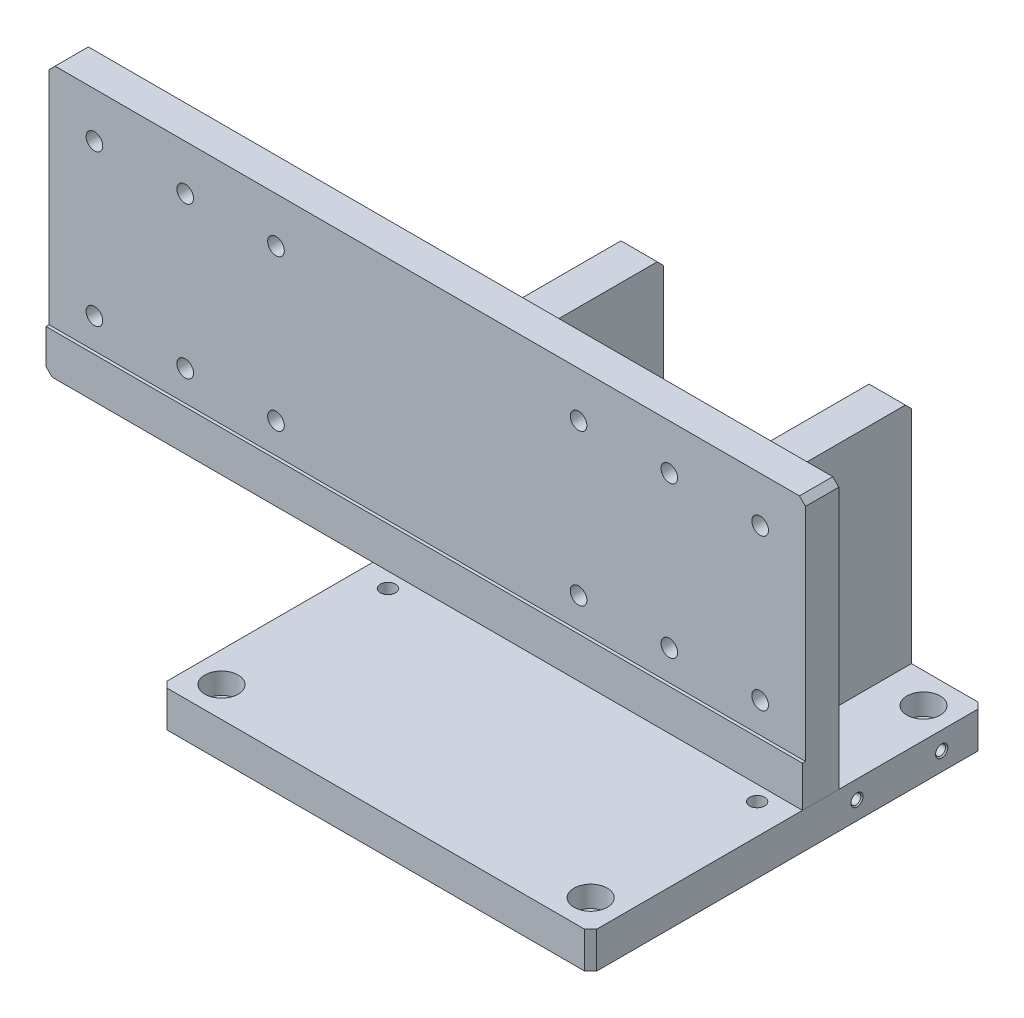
from build123d import *

# Parameters (mm, degrees)
SKETCH_1_W                  = 142
SKETCH_1_H                  = 130
EXTRUDE_1_DEPTH             = 12
SKETCH_2_W                  = 250
SKETCH_2_H                  = 12
EXTRUDE_2_DEPTH             = 88.5
SKETCH_3_W                  = 250
SKETCH_3_H                  = 75
CUT_EXTRUDE_1_DEPTH         = 1
SKETCH_4_W                  = 12
SKETCH_4_H                  = 48
EXTRUDE_3_DEPTH             = 75
EXTRUDE_3_2_DEPTH           = 75
CUT_EXTRUDE_2_DEPTH         = 179.183192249
HOLE_WIZARD_M6_1_AT_2_COUNT = 2
HOLE_WIZARD_M6_1_AT_2_PITCH = 122
HOLE_WIZARD_M6_1_AT_3_COUNT = 2
HOLE_WIZARD_M6_1_AT_3_PITCH = 110
HOLE_WIZARD_M6_1_AT_4_COUNT = 2
HOLE_WIZARD_M6_1_AT_4_PITCH = 164.268073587
SKETCH_9_W                  = 2.5
SKETCH_9_H                  = 12
F_5_0MM_1_AT_2_COUNT        = 2
F_5_0MM_1_AT_2_PITCH        = 122
HOLE_WIZARD_M4_1_AT_2_COUNT = 2
HOLE_WIZARD_M4_1_AT_2_PITCH = 28
HOLE_WIZARD_M5_1_AT_2_COUNT = 2
HOLE_WIZARD_M5_1_AT_2_PITCH = 30
HOLE_WIZARD_M5_1_AT_3_COUNT = 2
HOLE_WIZARD_M5_1_AT_3_PITCH = 60
HOLE_WIZARD_M5_1_AT_4_COUNT = 2
HOLE_WIZARD_M5_1_AT_4_PITCH = 50
HOLE_WIZARD_M5_1_AT_5_COUNT = 2
HOLE_WIZARD_M5_1_AT_5_PITCH = 58.309518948
HOLE_WIZARD_M5_1_AT_6_COUNT = 2
HOLE_WIZARD_M5_1_AT_6_PITCH = 78.102496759
PATTERN_LINEAR_1_COUNT      = 2
PATTERN_LINEAR_1_PITCH      = 160
CHAMFER_1_SIZE              = 2
CHAMFER_2_SIZE              = 2


with BuildPart() as part:
    # Sketch 1 → Extrude 1 (new body)
    with BuildSketch(Plane(origin=(0, 0, 0), x_dir=(1, 0, 0), z_dir=(0, 1, 0))):
        Rectangle(SKETCH_1_W, SKETCH_1_H)
    extrude(amount=EXTRUDE_1_DEPTH)

    # Sketch 7 → Hole Wizard M6 _ _ _ _ _1 (revolve, cut)
    with BuildSketch(Plane(origin=(-61, 12, -55), x_dir=(0, 0, 1), z_dir=(1, 0, 0))):
        Polygon((0, 0), (0, 12), (3.3, 12), (3.3, 7), (5.5, 7), (5.5, 0), align=None)
    hole_wizard_m6_1 = revolve(axis=Axis((-61, 18.35, -55), (0, -1, 0)), mode=Mode.SUBTRACT)

    # Hole Wizard M6 _ _ _ _ _1 at 2: Hole Wizard M6 _ _ _ _ _1 ×2
    with Locations(*[(i * HOLE_WIZARD_M6_1_AT_2_PITCH, 0, 0) for i in range(1, HOLE_WIZARD_M6_1_AT_2_COUNT)]):
        add(hole_wizard_m6_1, mode=Mode.SUBTRACT)

    # Hole Wizard M6 _ _ _ _ _1 at 3: Hole Wizard M6 _ _ _ _ _1 ×2
    with Locations(*[(0, 0, i * HOLE_WIZARD_M6_1_AT_3_PITCH) for i in range(1, HOLE_WIZARD_M6_1_AT_3_COUNT)]):
        add(hole_wizard_m6_1, mode=Mode.SUBTRACT)

    # Hole Wizard M6 _ _ _ _ _1 at 4: Hole Wizard M6 _ _ _ _ _1 ×2
    with Locations(*[Vector(0.742688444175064, 0, 0.6696371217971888) * (i * HOLE_WIZARD_M6_1_AT_4_PITCH) for i in range(1, HOLE_WIZARD_M6_1_AT_4_COUNT)]):
        add(hole_wizard_m6_1, mode=Mode.SUBTRACT)

    # Sketch 9 → 5.0mm _ _1 (revolve, cut)
    with BuildSketch(Plane(origin=(-61, 12, 0), x_dir=(0, 0, 1), z_dir=(1, 0, 0))):
        with Locations((1.25, 6)):
            Rectangle(SKETCH_9_W, SKETCH_9_H)
    f_5_0mm_1 = revolve(axis=Axis((-61, 18.35, 0), (0, -1, 0)), mode=Mode.SUBTRACT)

    # 5.0mm _ _1 at 2: 5.0mm _ _1 ×2
    with Locations(*[(i * F_5_0MM_1_AT_2_PITCH, 0, 0) for i in range(1, F_5_0MM_1_AT_2_COUNT)]):
        add(f_5_0mm_1, mode=Mode.SUBTRACT)

    # Sketch 13 → Hole Wizard M4 _ _1 (revolve, cut)
    with BuildSketch(Plane(origin=(71, 6, -51), x_dir=(0, 0, -1), z_dir=(0, 1, 0))):
        Polygon((0, 0), (0, 4.991420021), (1.65, 4), (1.65, 0.375), (2.025, 0), align=None)
    hole_wizard_m4_1 = revolve(axis=Axis((77.35, 6, -51), (-1, 0, 0)), mode=Mode.SUBTRACT)

    # Hole Wizard M4 _ _1 at 2: Hole Wizard M4 _ _1 ×2
    with Locations(*[(0, 0, i * HOLE_WIZARD_M4_1_AT_2_PITCH) for i in range(1, HOLE_WIZARD_M4_1_AT_2_COUNT)]):
        add(hole_wizard_m4_1, mode=Mode.SUBTRACT)

    # Chamfer 2
    chamfer_2_edges = [part.edges().sort_by_distance(p)[0] for p in [
        (71, 6, 65),
        (-71, 6, 65),
        (-71, 6, -65),
        (71, 6, -65),
    ]]
    chamfer(chamfer_2_edges, length=CHAMFER_2_SIZE)


with BuildPart() as body_2:
    # Sketch 2 → Extrude 2 (new body)
    with BuildSketch(Plane(origin=(0, 12, 0), x_dir=(1, 0, 0), z_dir=(0, 1, 0))):
        with Locations((-54, 11)):
            Rectangle(SKETCH_2_W, SKETCH_2_H)
    extrude(amount=EXTRUDE_2_DEPTH)

    # Sketch 3 → Cut-Extrude 1 (cut)
    with BuildSketch(Plane.XY.offset(-5)):
        with Locations((-54, 63)):
            Rectangle(SKETCH_3_W, SKETCH_3_H)
    extrude(amount=-CUT_EXTRUDE_1_DEPTH, mode=Mode.SUBTRACT)

    # Sketch 15 → Hole Wizard M5 _ _ _ _ _1 (revolve, cut)
    with BuildSketch(Plane(origin=(56, 85.5, -17), x_dir=(0, 1, 0), z_dir=(1, 0, 0))):
        Polygon((0, 0), (0, 82), (2.75, 82), (2.75, 6), (4.75, 6), (4.75, 0), align=None)
    hole_wizard_m5_1 = revolve(axis=Axis((56, 85.5, -23.35), (0, 0, 1)), mode=Mode.SUBTRACT)

    # Hole Wizard M5 _ _ _ _ _1 at 2: Hole Wizard M5 _ _ _ _ _1 ×2
    with Locations(*[(-i * HOLE_WIZARD_M5_1_AT_2_PITCH, 0, 0) for i in range(1, HOLE_WIZARD_M5_1_AT_2_COUNT)]):
        add(hole_wizard_m5_1, mode=Mode.SUBTRACT)

    # Hole Wizard M5 _ _ _ _ _1 at 3: Hole Wizard M5 _ _ _ _ _1 ×2
    with Locations(*[(-i * HOLE_WIZARD_M5_1_AT_3_PITCH, 0, 0) for i in range(1, HOLE_WIZARD_M5_1_AT_3_COUNT)]):
        add(hole_wizard_m5_1, mode=Mode.SUBTRACT)

    # Hole Wizard M5 _ _ _ _ _1 at 4: Hole Wizard M5 _ _ _ _ _1 ×2
    with Locations(*[(0, -i * HOLE_WIZARD_M5_1_AT_4_PITCH, 0) for i in range(1, HOLE_WIZARD_M5_1_AT_4_COUNT)]):
        add(hole_wizard_m5_1, mode=Mode.SUBTRACT)

    # Hole Wizard M5 _ _ _ _ _1 at 5: Hole Wizard M5 _ _ _ _ _1 ×2
    with Locations(*[Vector(-0.5144957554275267, -0.8574929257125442, 0) * (i * HOLE_WIZARD_M5_1_AT_5_PITCH) for i in range(1, HOLE_WIZARD_M5_1_AT_5_COUNT)]):
        add(hole_wizard_m5_1, mode=Mode.SUBTRACT)

    # Hole Wizard M5 _ _ _ _ _1 at 6: Hole Wizard M5 _ _ _ _ _1 ×2
    with Locations(*[Vector(-0.7682212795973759, -0.6401843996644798, 0) * (i * HOLE_WIZARD_M5_1_AT_6_PITCH) for i in range(1, HOLE_WIZARD_M5_1_AT_6_COUNT)]):
        add(hole_wizard_m5_1, mode=Mode.SUBTRACT)

    # Pattern Linear 1: Hole Wizard M5 _ _ _ _ _1 ×2
    with Locations(*[(-i * PATTERN_LINEAR_1_PITCH, 0, 0) for i in range(1, PATTERN_LINEAR_1_COUNT)]):
        add(hole_wizard_m5_1, mode=Mode.SUBTRACT)

    # Pattern Linear 1 copy 1 sketch → Pattern Linear 1 copy 1 (revolve, cut)
    with BuildSketch(Plane(origin=(-134, 85.5, -17), x_dir=(0, 1, 0), z_dir=(1, 0, 0))):
        Polygon((0, 0), (0, 82), (2.75, 82), (2.75, 6), (4.75, 6), (4.75, 0), align=None)
    revolve(axis=Axis((-134, 85.5, -23.35), (0, 0, 1)), mode=Mode.SUBTRACT)

    # Pattern Linear 1 copy 2 sketch → Pattern Linear 1 copy 2 (revolve, cut)
    with BuildSketch(Plane(origin=(-164, 85.5, -17), x_dir=(0, 1, 0), z_dir=(1, 0, 0))):
        Polygon((0, 0), (0, 82), (2.75, 82), (2.75, 6), (4.75, 6), (4.75, 0), align=None)
    revolve(axis=Axis((-164, 85.5, -23.35), (0, 0, 1)), mode=Mode.SUBTRACT)

    # Pattern Linear 1 copy 3 sketch → Pattern Linear 1 copy 3 (revolve, cut)
    with BuildSketch(Plane(origin=(-104, 35.5, -17), x_dir=(0, 1, 0), z_dir=(1, 0, 0))):
        Polygon((0, 0), (0, 82), (2.75, 82), (2.75, 6), (4.75, 6), (4.75, 0), align=None)
    revolve(axis=Axis((-104, 35.5, -23.35), (0, 0, 1)), mode=Mode.SUBTRACT)

    # Pattern Linear 1 copy 4 sketch → Pattern Linear 1 copy 4 (revolve, cut)
    with BuildSketch(Plane(origin=(-134, 35.5, -17), x_dir=(0, 1, 0), z_dir=(1, 0, 0))):
        Polygon((0, 0), (0, 82), (2.75, 82), (2.75, 6), (4.75, 6), (4.75, 0), align=None)
    revolve(axis=Axis((-134, 35.5, -23.35), (0, 0, 1)), mode=Mode.SUBTRACT)

    # Pattern Linear 1 copy 5 sketch → Pattern Linear 1 copy 5 (revolve, cut)
    with BuildSketch(Plane(origin=(-164, 35.5, -17), x_dir=(0, 1, 0), z_dir=(1, 0, 0))):
        Polygon((0, 0), (0, 82), (2.75, 82), (2.75, 6), (4.75, 6), (4.75, 0), align=None)
    revolve(axis=Axis((-164, 35.5, -23.35), (0, 0, 1)), mode=Mode.SUBTRACT)

    # Chamfer 1
    chamfer_1_edges = [body_2.edges().sort_by_distance(p)[0] for p in [
        (-179, 100.5, -11.5),
        (71, 100.5, -11.5),
        (-179, 12, -11),
    ]]
    chamfer(chamfer_1_edges, length=CHAMFER_1_SIZE)


with BuildPart() as body_3:
    # Sketch 4 → Extrude 3 (new body)
    with BuildSketch(Plane(origin=(0, 12, 0), x_dir=(1, 0, 0), z_dir=(0, 1, 0))):
        with Locations((-41, 41)):
            Rectangle(SKETCH_4_W, SKETCH_4_H)
    extrude(amount=EXTRUDE_3_DEPTH)


with BuildPart() as body_4:
    # Sketch 4 → Extrude 3 2 (new body)
    with BuildSketch(Plane(origin=(0, 12, 0), x_dir=(1, 0, 0), z_dir=(0, 1, 0))):
        with Locations((41, 41)):
            Rectangle(SKETCH_4_W, SKETCH_4_H)
    extrude(amount=EXTRUDE_3_2_DEPTH)


with BuildPart() as cut_extrude_2_tool:
    # Sketch 5 → Cut-Extrude 2 (new, through all)
    with BuildSketch(Plane.ZY.offset(47)):
        Polygon((-65, 87), (-65, 85), (-63, 87), align=None)
    extrude(amount=-CUT_EXTRUDE_2_DEPTH)


with BuildPart() as body_3_1:
    add(body_3.part)

    # Cut-Extrude 2: cut by cut_extrude_2_tool
    add(cut_extrude_2_tool.part, mode=Mode.SUBTRACT)


with BuildPart() as body_4_1:
    add(body_4.part)

    # Cut-Extrude 2: cut by cut_extrude_2_tool
    add(cut_extrude_2_tool.part, mode=Mode.SUBTRACT)


solid = Compound([part.part, body_2.part, body_3_1.part, body_4_1.part])
